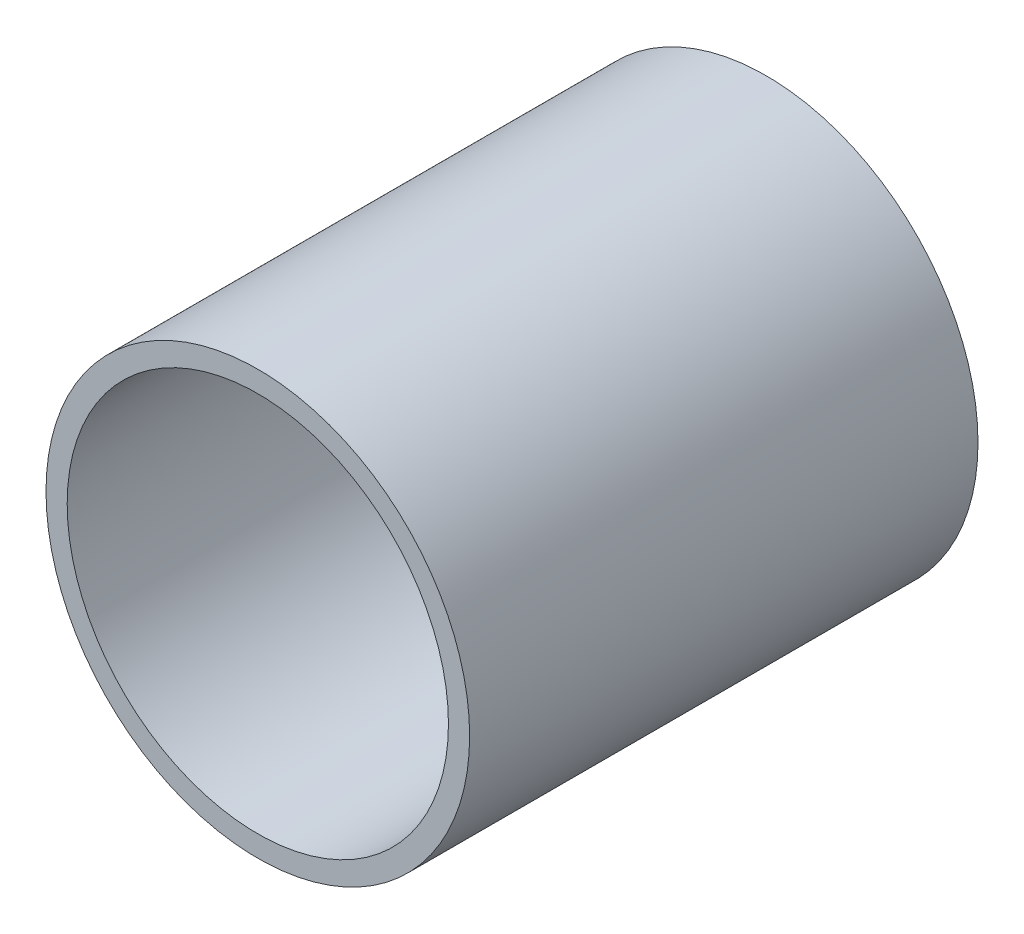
from build123d import *

# Parameters (mm, degrees)
ESQUISSE1_R      = 50
ESQUISSE1_R_2    = 45
EXTRUSION1_DEPTH = 120


with BuildPart() as part:
    # Esquisse1 → Extrusion1 (new body)
    with BuildSketch(Plane.XY):
        Circle(ESQUISSE1_R)
        Circle(ESQUISSE1_R_2, mode=Mode.SUBTRACT)
    extrude(amount=EXTRUSION1_DEPTH)


solid = part.part
